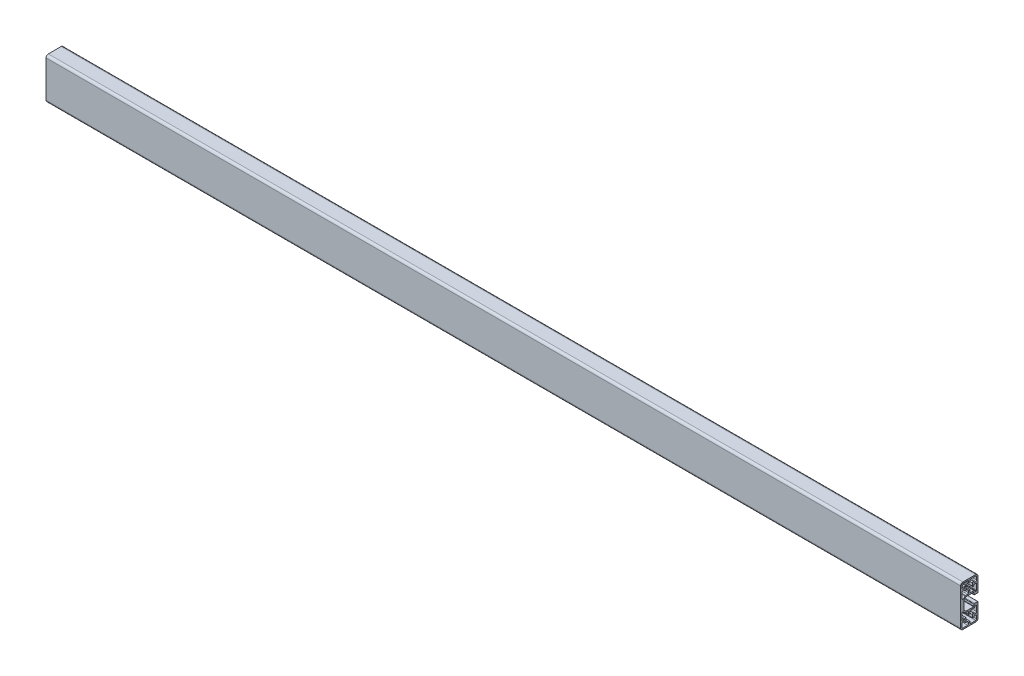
from build123d import *

# Parameters (mm, degrees)
F_45_SARJA_1_0169_45X19_KEVYT_MUSTA_1_DEPTH = 1000


with BuildPart() as part:
    # Sketch1 → 45-sarja 1.0169 45X19 KEVYT MUSTA_1 (new body)
    with BuildSketch(Plane(origin=(0, 0, 0), x_dir=(0, 0, -1), z_dir=(1, 0, 0))):
        with BuildLine():
            Line((7.000002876, 22.5), (-7.000002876, 22.5))
            ThreePointArc((-7.000002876, 22.5), (-8.767769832, 21.767766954), (-9.500002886, 20))
            Line((-9.500002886, 20), (-9.500002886, -20))
            ThreePointArc((-9.500002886, -20), (-8.767769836, -21.76776695), (-7.000002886, -22.5))
            Line((-7.000002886, -22.5), (6.999997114, -22.5))
            ThreePointArc((6.999997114, -22.5), (8.767764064, -21.76776695), (9.499997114, -20))
            Line((9.499997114, -20), (9.499997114, -4.3999939))
            ThreePointArc((9.499997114, -4.3999939), (9.412128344, -4.18786409), (9.199994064, -4.10000611))
            Line((9.199994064, -4.10000611), (5.499997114, -4.10000611))
            ThreePointArc((5.499997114, -4.10000611), (5.146443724, -4.24645272), (4.999997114, -4.60000611))
            Line((4.999997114, -4.60000611), (4.999997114, -6.50000001))
            ThreePointArc((4.999997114, -6.50000001), (4.912126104, -6.71213205), (4.699994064, -6.80000306))
            Line((4.699994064, -6.80000306), (-3.800005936, -6.80000306))
            Line((-3.800005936, -6.80000306), (-5.800005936, -4.80000306))
            Line((-5.800005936, -4.80000306), (-5.800005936, 4.80000304))
            Line((-5.800005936, 4.80000304), (-3.800005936, 6.80000304))
            Line((-3.800005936, 6.80000304), (4.69998672, 6.80000304))
            ThreePointArc((4.69998672, 6.80000304), (4.912126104, 6.71213203), (4.999997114, 6.499992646))
            Line((4.999997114, 6.499992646), (4.999997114, 4.600006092))
            ThreePointArc((4.999997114, 4.600006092), (5.146443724, 4.2464527), (5.499997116, 4.10000609))
            Line((5.499997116, 4.10000609), (9.200012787, 4.10000609))
            ThreePointArc((9.200012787, 4.10000609), (9.412133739, 4.187869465), (9.499997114, 4.399990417))
            Line((9.499997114, 4.399990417), (9.499997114, 19.99999999))
            ThreePointArc((9.499997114, 19.99999999), (8.767766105, 21.767764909), (7.000002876, 22.5))
        make_face()
        with BuildLine():
            Line((-4.672813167, 7.907095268), (-6.392904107, 6.187004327))
            ThreePointArc((-6.392904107, 6.187004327), (-7.482694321, 5.970231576), (-8.10001089, 6.894111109))
            Line((-8.10001089, 6.894111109), (-8.10001089, 13.200000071))
            ThreePointArc((-8.10001089, 13.200000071), (-7.80711767, 13.907106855), (-7.100010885, 14.200000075))
            Line((-7.100010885, 14.200000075), (-5.623730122, 14.200000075))
            ThreePointArc((-5.623730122, 14.200000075), (-5.311925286, 14.090868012), (-5.136232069, 13.811111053))
            ThreePointArc((-5.136232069, 13.811111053), (-5.053478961, 13.493371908), (-4.951390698, 13.181307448))
            ThreePointArc((-4.951390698, 13.181307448), (-3.927079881, 12.700904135), (-3.446676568, 13.725214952))
            ThreePointArc((-3.446676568, 13.725214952), (-3.674868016, 14.999999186), (-3.446676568, 16.274783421))
            ThreePointArc((-3.446676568, 16.274783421), (-3.927078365, 17.299095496), (-4.951390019, 16.818692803))
            ThreePointArc((-4.951390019, 16.818692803), (-5.053478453, 16.506628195), (-5.136231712, 16.18888889))
            ThreePointArc((-5.136231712, 16.18888889), (-5.311924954, 15.90913203), (-5.623729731, 15.800000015))
            Line((-5.623729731, 15.800000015), (-7.100010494, 15.800000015))
            ThreePointArc((-7.100010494, 15.800000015), (-7.807117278, 16.092893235), (-8.100010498, 16.800000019))
            Line((-8.100010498, 16.800000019), (-8.100010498, 20.10000211))
            ThreePointArc((-8.100010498, 20.10000211), (-7.807117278, 20.807108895), (-7.100010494, 21.100002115))
            Line((-7.100010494, 21.100002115), (-1.800002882, 21.100002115))
            ThreePointArc((-1.800002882, 21.100002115), (-1.092896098, 20.807108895), (-0.800002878, 20.10000211))
            Line((-0.800002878, 20.10000211), (-0.800002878, 18.828130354))
            ThreePointArc((-0.800002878, 18.828130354), (-0.730014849, 18.676153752), (-0.569034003, 18.630542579))
            ThreePointArc((-0.569034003, 18.630542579), (-2.907e-06, 18.674865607), (0.56902822, 18.630542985))
            ThreePointArc((0.56902822, 18.630542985), (0.730008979, 18.676154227), (0.799996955, 18.828130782))
            Line((0.799996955, 18.828130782), (0.799996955, 20.100003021))
            ThreePointArc((0.799996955, 20.100003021), (1.092890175, 20.807109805), (1.799996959, 21.100003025))
            Line((1.799996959, 21.100003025), (7.100004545, 21.100003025))
            ThreePointArc((7.100004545, 21.100003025), (7.807111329, 20.807109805), (8.100004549, 20.100003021))
            Line((8.100004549, 20.100003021), (8.100004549, 16.800000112))
            ThreePointArc((8.100004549, 16.800000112), (7.807111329, 16.092893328), (7.100004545, 15.800000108))
            Line((7.100004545, 15.800000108), (5.623723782, 15.800000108))
            ThreePointArc((5.623723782, 15.800000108), (5.311919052, 15.909132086), (5.136225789, 16.188888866))
            ThreePointArc((5.136225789, 16.188888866), (5.053472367, 16.506628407), (4.95138372, 16.818693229))
            ThreePointArc((4.95138372, 16.818693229), (3.927253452, 17.299161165), (3.446539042, 16.275146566))
            ThreePointArc((3.446539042, 16.275146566), (3.674864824, 14.999999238), (3.446539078, 13.724851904))
            ThreePointArc((3.446539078, 13.724851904), (3.927254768, 12.700838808), (4.951383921, 13.181307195))
            ThreePointArc((4.951383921, 13.181307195), (5.053472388, 13.493371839), (5.136225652, 13.81111119))
            ThreePointArc((5.136225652, 13.81111119), (5.311918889, 14.090868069), (5.623723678, 14.200000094))
            Line((5.623723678, 14.200000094), (7.100004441, 14.200000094))
            ThreePointArc((7.100004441, 14.200000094), (7.807111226, 13.907106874), (8.100004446, 13.20000009))
            Line((8.100004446, 13.20000009), (8.100004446, 6.799999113))
            ThreePointArc((8.100004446, 6.799999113), (8.012136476, 6.587867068), (7.800004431, 6.499999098))
            Line((7.800004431, 6.499999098), (6.699765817, 6.499999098))
            ThreePointArc((6.699765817, 6.499999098), (6.487793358, 6.587809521), (6.400012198, 6.799794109))
            ThreePointArc((6.400012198, 6.799794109), (5.990030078, 7.789868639), (5.000012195, 8.199987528))
            Line((5.000012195, 8.199987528), (1.799996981, 8.199987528))
            ThreePointArc((1.799996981, 8.199987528), (1.092890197, 8.492880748), (0.799996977, 9.199987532))
            Line((0.799996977, 9.199987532), (0.799996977, 11.171867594))
            ThreePointArc((0.799996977, 11.171867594), (0.730009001, 11.32384415), (0.569028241, 11.369455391))
            ThreePointArc((0.569028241, 11.369455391), (-3.084e-06, 11.325132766), (-0.569034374, 11.369455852))
            ThreePointArc((-0.569034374, 11.369455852), (-0.730015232, 11.323844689), (-0.80000327, 11.17186808))
            Line((-0.80000327, 11.17186808), (-0.80000327, 9.199988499))
            ThreePointArc((-0.80000327, 9.199988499), (-1.09289649, 8.492881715), (-1.800003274, 8.199988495))
            Line((-1.800003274, 8.199988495), (-3.965706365, 8.199988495))
            ThreePointArc((-3.965706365, 8.199988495), (-4.348389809, 8.123868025), (-4.672813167, 7.907095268))
        make_face(mode=Mode.SUBTRACT)
        with BuildLine():
            Line((-6.392873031, -6.186992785), (-4.672782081, -7.907083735))
            ThreePointArc((-4.672782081, -7.907083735), (-4.348358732, -8.123856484), (-3.965675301, -8.199976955))
            Line((-3.965675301, -8.199976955), (-1.799972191, -8.199976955))
            ThreePointArc((-1.799972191, -8.199976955), (-1.092865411, -8.492870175), (-0.799972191, -9.199976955))
            Line((-0.799972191, -9.199976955), (-0.799972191, -11.413120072))
            ThreePointArc((-0.799972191, -11.413120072), (2.7818e-05, -11.32498848), (0.800027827, -11.41312007))
            Line((0.800027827, -11.41312007), (0.800027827, -9.199976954))
            ThreePointArc((0.800027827, -9.199976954), (1.092921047, -8.492870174), (1.800027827, -8.199976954))
            Line((1.800027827, -8.199976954), (5.000043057, -8.199976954))
            ThreePointArc((5.000043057, -8.199976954), (5.989992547, -7.789926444), (6.400043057, -6.799976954))
            ThreePointArc((6.400043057, -6.799976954), (6.487915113, -6.587852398), (6.700043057, -6.499988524))
            Line((6.700043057, -6.499988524), (7.800035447, -6.499988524))
            ThreePointArc((7.800035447, -6.499988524), (8.012167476, -6.587856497), (8.100035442, -6.799988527))
            Line((8.100035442, -6.799988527), (8.100035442, -13.199988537))
            ThreePointArc((8.100035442, -13.199988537), (7.807142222, -13.907095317), (7.100035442, -14.199988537))
            Line((7.100035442, -14.199988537), (5.623911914, -14.199952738))
            ThreePointArc((5.623911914, -14.199952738), (5.312107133, -14.090820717), (5.136413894, -13.811063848))
            ThreePointArc((5.136413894, -13.811063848), (5.053660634, -13.493324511), (4.951572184, -13.181259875))
            ThreePointArc((4.951572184, -13.181259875), (3.927251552, -12.70083589), (3.446827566, -13.725156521))
            ThreePointArc((3.446827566, -13.725156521), (3.675027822, -14.999944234), (3.446858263, -16.274737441))
            ThreePointArc((3.446858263, -16.274737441), (3.927261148, -17.299048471), (4.951572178, -16.818645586))
            ThreePointArc((4.951572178, -16.818645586), (5.053660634, -16.506580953), (5.1364139, -16.188841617))
            ThreePointArc((5.1364139, -16.188841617), (5.309774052, -15.910957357), (5.617928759, -15.799988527))
            Line((5.617928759, -15.799988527), (7.100035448, -15.799988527))
            ThreePointArc((7.100035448, -15.799988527), (7.807142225, -16.092881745), (8.100035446, -16.799988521))
            Line((8.100035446, -16.799988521), (8.100035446, -20.099990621))
            ThreePointArc((8.100035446, -20.099990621), (7.807142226, -20.807097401), (7.100035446, -21.099990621))
            Line((7.100035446, -21.099990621), (1.800027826, -21.099990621))
            ThreePointArc((1.800027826, -21.099990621), (1.092921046, -20.807097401), (0.800027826, -20.099990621))
            Line((0.800027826, -20.099990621), (0.800027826, -18.586856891))
            ThreePointArc((0.800027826, -18.586856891), (2.7829e-05, -18.67498848), (-0.799972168, -18.586856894))
            Line((-0.799972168, -18.586856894), (-0.799972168, -20.099990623))
            ThreePointArc((-0.799972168, -20.099990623), (-1.092865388, -20.807097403), (-1.799972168, -21.099990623))
            Line((-1.799972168, -21.099990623), (-7.099979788, -21.099990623))
            ThreePointArc((-7.099979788, -21.099990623), (-7.807086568, -20.807097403), (-8.099979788, -20.099990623))
            Line((-8.099979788, -20.099990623), (-8.099979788, -16.799988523))
            ThreePointArc((-8.099979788, -16.799988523), (-7.807086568, -16.092881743), (-7.099979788, -15.799988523))
            Line((-7.099979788, -15.799988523), (-5.617533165, -15.799988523))
            ThreePointArc((-5.617533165, -15.799988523), (-5.309586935, -15.911060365), (-5.136359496, -16.188837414))
            ThreePointArc((-5.136359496, -16.188837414), (-5.053605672, -16.506578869), (-4.951516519, -16.818645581))
            ThreePointArc((-4.951516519, -16.818645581), (-3.927205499, -17.299048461), (-3.446802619, -16.274737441))
            ThreePointArc((-3.446802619, -16.274737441), (-3.674972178, -14.999944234), (-3.446771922, -13.725156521))
            ThreePointArc((-3.446771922, -13.725156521), (-3.927174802, -12.700845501), (-4.951485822, -13.181248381))
            ThreePointArc((-4.951485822, -13.181248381), (-5.053574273, -13.493313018), (-5.136327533, -13.811052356))
            ThreePointArc((-5.136327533, -13.811052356), (-5.312020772, -14.090809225), (-5.623825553, -14.199941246))
            Line((-5.623825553, -14.199941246), (-7.099979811, -14.199988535))
            ThreePointArc((-7.099979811, -14.199988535), (-7.807086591, -13.907095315), (-8.099979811, -13.199988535))
            Line((-8.099979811, -13.199988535), (-8.099979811, -6.894099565))
            ThreePointArc((-8.099979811, -6.894099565), (-7.482663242, -5.970220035), (-6.392873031, -6.186992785))
        make_face(mode=Mode.SUBTRACT)
    extrude(amount=F_45_SARJA_1_0169_45X19_KEVYT_MUSTA_1_DEPTH)


solid = part.part
